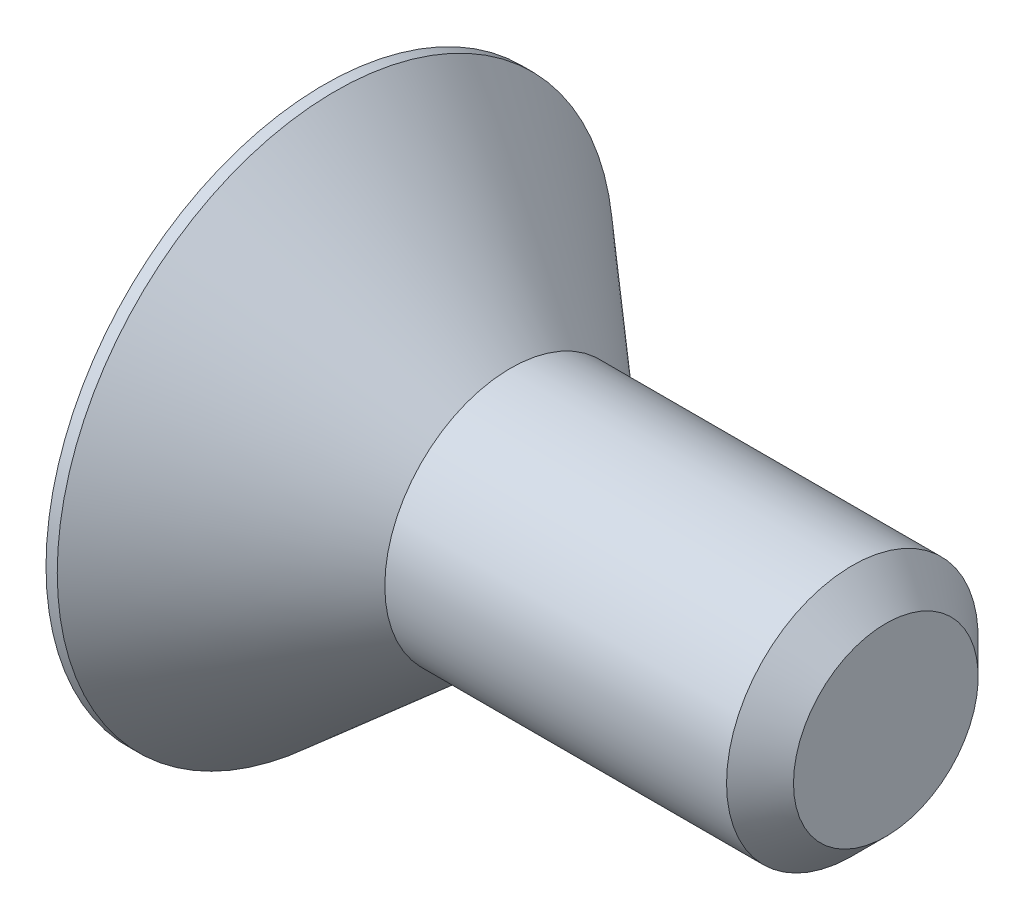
from build123d import *

# Parameters (mm, degrees)
HEX_2_DEPTH = 1.397


with BuildPart() as part:
    # BodySke → BaseBody (revolve)
    with BuildSketch(Plane.XY, mode=Mode.PRIVATE) as basebody_sk:
        Polygon((0, 0), (0, 3.14452), (0.127, 3.14452), (2.108072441, 1.4224), (5.97154, 1.4224), (6.35, 1.04394), (6.35, 0), align=None)
    revolve(basebody_sk.sketch.rotate(Axis((0, 0, 0), (1, 0, 0)), 90), axis=Axis((0, 0, 0), (1, 0, 0)))

    # Sketch2 → PreBroach (revolve, cut)
    with BuildSketch(Plane.XY, mode=Mode.PRIVATE) as prebroach_sk:
        Polygon((0, 0.79375), (1.397, 0.79375), (1.855271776, 0), (0, 0), align=None)
    revolve(prebroach_sk.sketch.rotate(Axis((0, 0, 0), (1, 0, 0)), 90), axis=Axis((0, 0, 0), (1, 0, 0)), mode=Mode.SUBTRACT)

    # Sketch3 → Hex 2 (cut)
    with BuildSketch(Plane.ZY):
        Polygon((-0.79375, -0.458271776), (-0.79375, 0.458271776), (0, 0.916543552), (0.79375, 0.458271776), (0.79375, -0.458271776), (0, -0.916543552), align=None)
    extrude(amount=-HEX_2_DEPTH, mode=Mode.SUBTRACT)


solid = part.part
